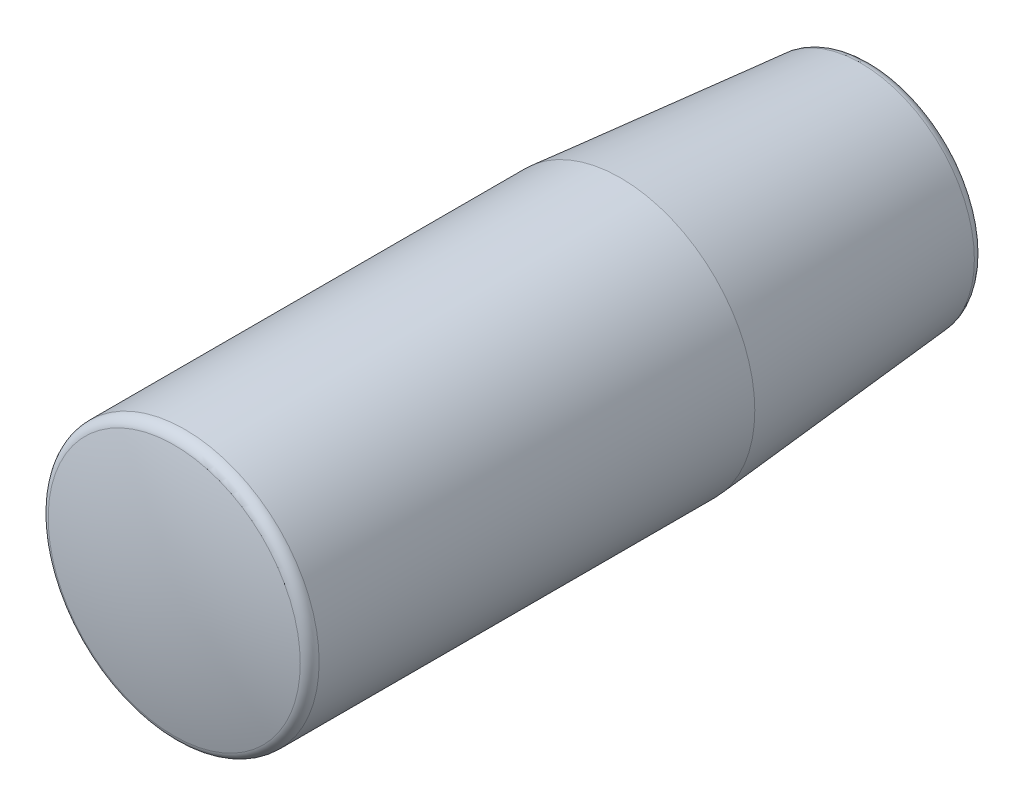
ISO-10303-21;
HEADER;
FILE_DESCRIPTION(('STEP AP214'),'2;1');
FILE_NAME('part.step','',(''),(''),'','','');
FILE_SCHEMA(('AUTOMOTIVE_DESIGN { 1 0 10303 214 1 1 1 1 }'));
ENDSEC;
DATA;
#1=APPLICATION_CONTEXT('core data for automotive mechanical design processes');
#2=APPLICATION_PROTOCOL_DEFINITION('international standard','automotive_design',2000,#1);
#3=PRODUCT_CONTEXT('',#1,'mechanical');
#4=PRODUCT('Part','Part','',(#3));
#5=PRODUCT_RELATED_PRODUCT_CATEGORY('part','',(#4));
#6=PRODUCT_DEFINITION_FORMATION('','',#4);
#7=PRODUCT_DEFINITION_CONTEXT('part definition',#1,'design');
#8=PRODUCT_DEFINITION('design','',#6,#7);
#9=PRODUCT_DEFINITION_SHAPE('','',#8);
#10=(LENGTH_UNIT() NAMED_UNIT(*) SI_UNIT(.MILLI.,.METRE.));
#11=(NAMED_UNIT(*) PLANE_ANGLE_UNIT() SI_UNIT($,.RADIAN.));
#12=(NAMED_UNIT(*) SI_UNIT($,.STERADIAN.) SOLID_ANGLE_UNIT());
#13=UNCERTAINTY_MEASURE_WITH_UNIT(LENGTH_MEASURE(1.E-05),#10,'distance_accuracy_value','');
#14=(GEOMETRIC_REPRESENTATION_CONTEXT(3) GLOBAL_UNCERTAINTY_ASSIGNED_CONTEXT((#13)) GLOBAL_UNIT_ASSIGNED_CONTEXT((#10,
#11,#12)) REPRESENTATION_CONTEXT('',''));
#15=CARTESIAN_POINT('',(0.,0.,0.));
#16=DIRECTION('',(0.,0.,1.));
#17=DIRECTION('',(1.,0.,0.));
#18=AXIS2_PLACEMENT_3D('',#15,#16,#17);
#19=CARTESIAN_POINT('',(0.,0.,0.));
#20=DIRECTION('',(0.,0.,1.));
#21=DIRECTION('',(1.,0.,0.));
#22=AXIS2_PLACEMENT_3D('',#19,#20,#21);
#23=PLANE('',#22);
#24=CARTESIAN_POINT('',(0.,0.,0.));
#25=DIRECTION('',(0.,0.,1.));
#26=DIRECTION('',(1.,0.,0.));
#27=AXIS2_PLACEMENT_3D('',#24,#25,#26);
#28=CIRCLE('',#27,9.33366882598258);
#29=CARTESIAN_POINT('',(9.33366882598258,0.,0.));
#30=VERTEX_POINT('',#29);
#31=EDGE_CURVE('E8',#30,#30,#28,.T.);
#32=ORIENTED_EDGE('',*,*,#31,.F.);
#33=EDGE_LOOP('',(#32));
#34=FACE_BOUND('',#33,.T.);
#35=CARTESIAN_POINT('',(0.,0.,0.));
#36=DIRECTION('',(0.,0.,1.));
#37=DIRECTION('',(1.,0.,0.));
#38=AXIS2_PLACEMENT_3D('',#35,#36,#37);
#39=CIRCLE('',#38,5.5);
#40=CARTESIAN_POINT('',(5.5,0.,0.));
#41=VERTEX_POINT('',#40);
#42=EDGE_CURVE('E34',#41,#41,#39,.T.);
#43=ORIENTED_EDGE('',*,*,#42,.T.);
#44=EDGE_LOOP('',(#43));
#45=FACE_BOUND('',#44,.T.);
#46=ADVANCED_FACE('F12',(#34,#45),#23,.F.);
#47=CARTESIAN_POINT('',(0.,0.,1.));
#48=DIRECTION('',(0.,0.,1.));
#49=DIRECTION('',(1.,0.,0.));
#50=AXIS2_PLACEMENT_3D('',#47,#48,#49);
#51=TOROIDAL_SURFACE('',#50,9.33366882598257,1.);
#52=ORIENTED_EDGE('',*,*,#31,.T.);
#53=EDGE_LOOP('',(#52));
#54=FACE_BOUND('',#53,.T.);
#55=CARTESIAN_POINT('',(0.,0.,0.91284425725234));
#56=DIRECTION('',(0.,0.,1.));
#57=DIRECTION('',(1.,0.,0.));
#58=AXIS2_PLACEMENT_3D('',#55,#56,#57);
#59=CIRCLE('',#58,10.3298635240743);
#60=CARTESIAN_POINT('',(10.3298635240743,0.,0.91284425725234));
#61=VERTEX_POINT('',#60);
#62=EDGE_CURVE('E19',#61,#61,#59,.T.);
#63=ORIENTED_EDGE('',*,*,#62,.F.);
#64=EDGE_LOOP('',(#63));
#65=FACE_BOUND('',#64,.T.);
#66=ADVANCED_FACE('F72',(#54,#65),#51,.T.);
#67=CARTESIAN_POINT('',(0.,0.,0.91284425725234));
#68=DIRECTION('',(0.,0.,1.));
#69=DIRECTION('',(1.,0.,0.));
#70=AXIS2_PLACEMENT_3D('',#67,#68,#69);
#71=CONICAL_SURFACE('',#70,10.3298635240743,0.0872664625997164);
#72=CARTESIAN_POINT('',(0.,0.,22.8601046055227));
#73=DIRECTION('',(0.,0.,1.));
#74=DIRECTION('',(1.,0.,0.));
#75=AXIS2_PLACEMENT_3D('',#72,#73,#74);
#76=CIRCLE('',#75,12.25);
#77=CARTESIAN_POINT('',(12.25,0.,22.8601046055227));
#78=VERTEX_POINT('',#77);
#79=EDGE_CURVE('E23',#78,#78,#76,.T.);
#80=ORIENTED_EDGE('',*,*,#79,.F.);
#81=EDGE_LOOP('',(#80));
#82=FACE_BOUND('',#81,.T.);
#83=ORIENTED_EDGE('',*,*,#62,.T.);
#84=EDGE_LOOP('',(#83));
#85=FACE_BOUND('',#84,.T.);
#86=ADVANCED_FACE('F78',(#82,#85),#71,.T.);
#87=CARTESIAN_POINT('',(0.,0.,65.));
#88=DIRECTION('',(0.,0.,1.));
#89=DIRECTION('',(1.,0.,0.));
#90=AXIS2_PLACEMENT_3D('',#87,#88,#89);
#91=CYLINDRICAL_SURFACE('',#90,12.25);
#92=CARTESIAN_POINT('',(0.,0.,62.5953684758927));
#93=DIRECTION('',(0.,0.,1.));
#94=DIRECTION('',(1.,0.,0.));
#95=AXIS2_PLACEMENT_3D('',#92,#93,#94);
#96=CIRCLE('',#95,12.25);
#97=CARTESIAN_POINT('',(12.25,0.,62.5953684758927));
#98=VERTEX_POINT('',#97);
#99=EDGE_CURVE('E28',#98,#98,#96,.T.);
#100=ORIENTED_EDGE('',*,*,#99,.F.);
#101=EDGE_LOOP('',(#100));
#102=FACE_BOUND('',#101,.T.);
#103=ORIENTED_EDGE('',*,*,#79,.T.);
#104=EDGE_LOOP('',(#103));
#105=FACE_BOUND('',#104,.T.);
#106=ADVANCED_FACE('F101',(#102,#105),#91,.T.);
#107=CARTESIAN_POINT('',(0.,0.,62.5953684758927));
#108=DIRECTION('',(0.,0.,1.));
#109=DIRECTION('',(1.,0.,0.));
#110=AXIS2_PLACEMENT_3D('',#107,#108,#109);
#111=TOROIDAL_SURFACE('',#110,11.25,1.);
#112=ORIENTED_EDGE('',*,*,#99,.T.);
#113=EDGE_LOOP('',(#112));
#114=FACE_BOUND('',#113,.T.);
#115=CARTESIAN_POINT('',(0.,0.,63.5646689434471));
#116=DIRECTION('',(0.,0.,1.));
#117=DIRECTION('',(1.,0.,0.));
#118=AXIS2_PLACEMENT_3D('',#115,#116,#117);
#119=CIRCLE('',#118,11.4958792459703);
#120=CARTESIAN_POINT('',(11.4958792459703,0.,63.5646689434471));
#121=VERTEX_POINT('',#120);
#122=EDGE_CURVE('E31',#121,#121,#119,.T.);
#123=ORIENTED_EDGE('',*,*,#122,.F.);
#124=EDGE_LOOP('',(#123));
#125=FACE_BOUND('',#124,.T.);
#126=ADVANCED_FACE('F94',(#114,#125),#111,.T.);
#127=CARTESIAN_POINT('',(0.,-3.27862736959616E-13,18.2458333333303));
#128=DIRECTION('',(0.,0.,1.));
#129=DIRECTION('',(0.,-1.,0.));
#130=AXIS2_PLACEMENT_3D('',#127,#128,#129);
#131=SPHERICAL_SURFACE('',#130,46.7541666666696);
#132=ORIENTED_EDGE('',*,*,#122,.T.);
#133=EDGE_LOOP('',(#132));
#134=FACE_BOUND('',#133,.T.);
#135=ADVANCED_FACE('F84',(#134),#131,.T.);
#136=CARTESIAN_POINT('',(0.,0.,48.));
#137=DIRECTION('',(0.,0.,1.));
#138=DIRECTION('',(1.,0.,0.));
#139=AXIS2_PLACEMENT_3D('',#136,#137,#138);
#140=CYLINDRICAL_SURFACE('',#139,5.5);
#141=CARTESIAN_POINT('',(0.,0.,7.));
#142=DIRECTION('',(0.,0.,1.));
#143=DIRECTION('',(1.,0.,0.));
#144=AXIS2_PLACEMENT_3D('',#141,#142,#143);
#145=CIRCLE('',#144,5.5);
#146=CARTESIAN_POINT('',(5.5,0.,7.));
#147=VERTEX_POINT('',#146);
#148=EDGE_CURVE('E37',#147,#147,#145,.T.);
#149=ORIENTED_EDGE('',*,*,#148,.T.);
#150=EDGE_LOOP('',(#149));
#151=FACE_BOUND('',#150,.T.);
#152=ORIENTED_EDGE('',*,*,#42,.F.);
#153=EDGE_LOOP('',(#152));
#154=FACE_BOUND('',#153,.T.);
#155=ADVANCED_FACE('F82',(#151,#154),#140,.F.);
#156=CARTESIAN_POINT('',(0.,5.5,7.));
#157=DIRECTION('',(0.,0.,-1.));
#158=DIRECTION('',(-1.,0.,0.));
#159=AXIS2_PLACEMENT_3D('',#156,#157,#158);
#160=PLANE('',#159);
#161=CARTESIAN_POINT('',(0.,0.,7.));
#162=DIRECTION('',(0.,0.,-1.));
#163=DIRECTION('',(-1.,0.,0.));
#164=AXIS2_PLACEMENT_3D('',#161,#162,#163);
#165=CIRCLE('',#164,5.);
#166=CARTESIAN_POINT('',(-5.,0.,7.));
#167=VERTEX_POINT('',#166);
#168=EDGE_CURVE('E43',#167,#167,#165,.T.);
#169=ORIENTED_EDGE('',*,*,#168,.F.);
#170=EDGE_LOOP('',(#169));
#171=FACE_BOUND('',#170,.T.);
#172=ORIENTED_EDGE('',*,*,#148,.F.);
#173=EDGE_LOOP('',(#172));
#174=FACE_BOUND('',#173,.T.);
#175=ADVANCED_FACE('F68',(#171,#174),#160,.T.);
#176=CARTESIAN_POINT('',(0.,0.,40.));
#177=DIRECTION('',(0.,0.,-1.));
#178=DIRECTION('',(-1.,0.,0.));
#179=AXIS2_PLACEMENT_3D('',#176,#177,#178);
#180=CYLINDRICAL_SURFACE('',#179,5.);
#181=ORIENTED_EDGE('',*,*,#168,.T.);
#182=EDGE_LOOP('',(#181));
#183=FACE_BOUND('',#182,.T.);
#184=CARTESIAN_POINT('',(0.,0.,40.));
#185=DIRECTION('',(0.,0.,-1.));
#186=DIRECTION('',(-1.,0.,0.));
#187=AXIS2_PLACEMENT_3D('',#184,#185,#186);
#188=CIRCLE('',#187,5.);
#189=CARTESIAN_POINT('',(-5.,0.,40.));
#190=VERTEX_POINT('',#189);
#191=EDGE_CURVE('E46',#190,#190,#188,.T.);
#192=ORIENTED_EDGE('',*,*,#191,.F.);
#193=EDGE_LOOP('',(#192));
#194=FACE_BOUND('',#193,.T.);
#195=ADVANCED_FACE('F58',(#183,#194),#180,.F.);
#196=CARTESIAN_POINT('',(0.,0.,40.));
#197=DIRECTION('',(0.,0.,-1.));
#198=DIRECTION('',(-1.,0.,0.));
#199=AXIS2_PLACEMENT_3D('',#196,#197,#198);
#200=PLANE('',#199);
#201=CARTESIAN_POINT('',(0.,0.,40.));
#202=DIRECTION('',(0.,0.,-1.));
#203=DIRECTION('',(-1.,0.,0.));
#204=AXIS2_PLACEMENT_3D('',#201,#202,#203);
#205=CIRCLE('',#204,4.188);
#206=CARTESIAN_POINT('',(-4.188,0.,40.));
#207=VERTEX_POINT('',#206);
#208=EDGE_CURVE('E15',#207,#207,#205,.T.);
#209=ORIENTED_EDGE('',*,*,#208,.F.);
#210=EDGE_LOOP('',(#209));
#211=FACE_BOUND('',#210,.T.);
#212=ORIENTED_EDGE('',*,*,#191,.T.);
#213=EDGE_LOOP('',(#212));
#214=FACE_BOUND('',#213,.T.);
#215=ADVANCED_FACE('F55',(#211,#214),#200,.T.);
#216=CARTESIAN_POINT('',(0.,4.188,48.));
#217=DIRECTION('',(0.,0.,-1.));
#218=DIRECTION('',(-1.,0.,0.));
#219=AXIS2_PLACEMENT_3D('',#216,#217,#218);
#220=PLANE('',#219);
#221=CARTESIAN_POINT('',(0.,0.,48.));
#222=DIRECTION('',(0.,0.,1.));
#223=DIRECTION('',(1.,0.,0.));
#224=AXIS2_PLACEMENT_3D('',#221,#222,#223);
#225=CIRCLE('',#224,4.188);
#226=CARTESIAN_POINT('',(4.188,0.,48.));
#227=VERTEX_POINT('',#226);
#228=EDGE_CURVE('E40',#227,#227,#225,.T.);
#229=ORIENTED_EDGE('',*,*,#228,.F.);
#230=EDGE_LOOP('',(#229));
#231=FACE_BOUND('',#230,.T.);
#232=ADVANCED_FACE('F57',(#231),#220,.T.);
#233=CARTESIAN_POINT('',(0.,0.,48.));
#234=DIRECTION('',(0.,0.,1.));
#235=DIRECTION('',(1.,0.,0.));
#236=AXIS2_PLACEMENT_3D('',#233,#234,#235);
#237=CYLINDRICAL_SURFACE('',#236,4.188);
#238=ORIENTED_EDGE('',*,*,#228,.T.);
#239=EDGE_LOOP('',(#238));
#240=FACE_BOUND('',#239,.T.);
#241=ORIENTED_EDGE('',*,*,#208,.T.);
#242=EDGE_LOOP('',(#241));
#243=FACE_BOUND('',#242,.T.);
#244=ADVANCED_FACE('F53',(#240,#243),#237,.F.);
#245=CLOSED_SHELL('',(#46,#66,#86,#106,#126,#135,#155,#175,#195,#215,#232,#244));
#246=MANIFOLD_SOLID_BREP('B1',#245);
#247=ADVANCED_BREP_SHAPE_REPRESENTATION('',(#18,#246),#14);
#248=SHAPE_DEFINITION_REPRESENTATION(#9,#247);
ENDSEC;
END-ISO-10303-21;
